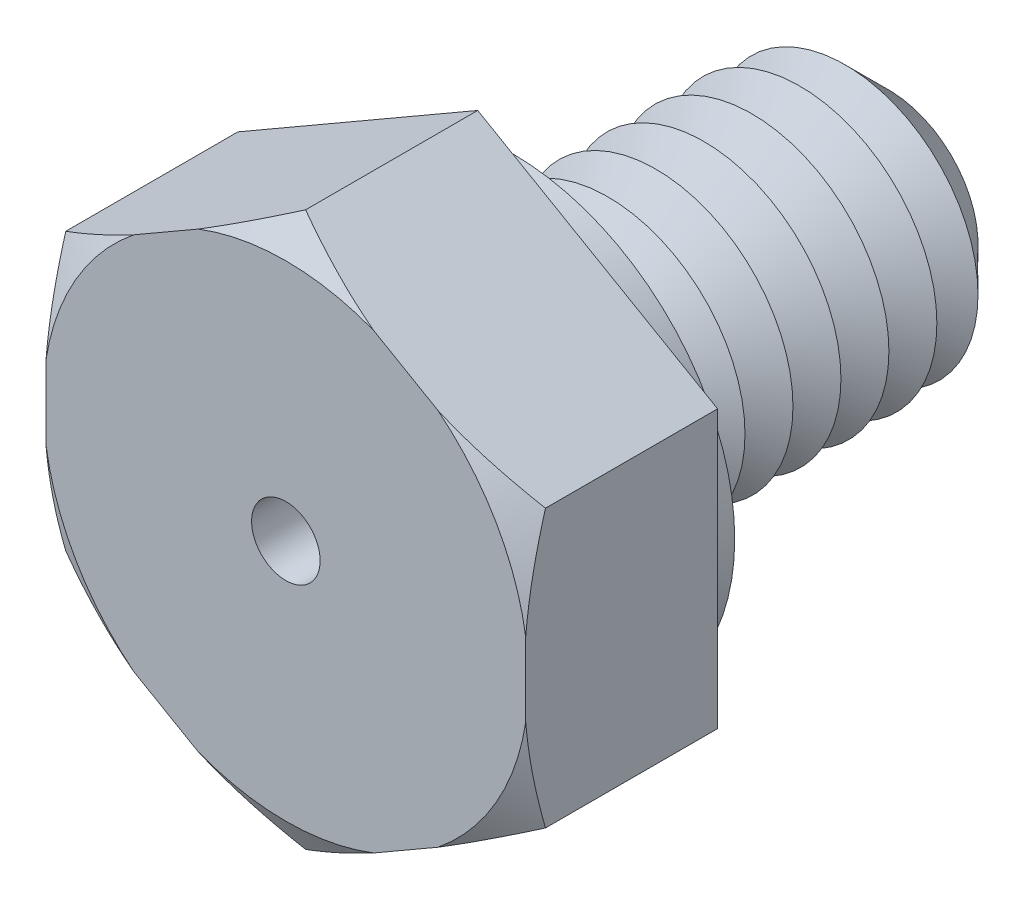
ISO-10303-21;
HEADER;
FILE_DESCRIPTION(('STEP AP214'),'2;1');
FILE_NAME('part.step','',(''),(''),'','','');
FILE_SCHEMA(('AUTOMOTIVE_DESIGN { 1 0 10303 214 1 1 1 1 }'));
ENDSEC;
DATA;
#1=APPLICATION_CONTEXT('core data for automotive mechanical design processes');
#2=APPLICATION_PROTOCOL_DEFINITION('international standard','automotive_design',2000,#1);
#3=PRODUCT_CONTEXT('',#1,'mechanical');
#4=PRODUCT('Part','Part','',(#3));
#5=PRODUCT_RELATED_PRODUCT_CATEGORY('part','',(#4));
#6=PRODUCT_DEFINITION_FORMATION('','',#4);
#7=PRODUCT_DEFINITION_CONTEXT('part definition',#1,'design');
#8=PRODUCT_DEFINITION('design','',#6,#7);
#9=PRODUCT_DEFINITION_SHAPE('','',#8);
#10=(LENGTH_UNIT() NAMED_UNIT(*) SI_UNIT(.MILLI.,.METRE.));
#11=(NAMED_UNIT(*) PLANE_ANGLE_UNIT() SI_UNIT($,.RADIAN.));
#12=(NAMED_UNIT(*) SI_UNIT($,.STERADIAN.) SOLID_ANGLE_UNIT());
#13=UNCERTAINTY_MEASURE_WITH_UNIT(LENGTH_MEASURE(1.E-05),#10,'distance_accuracy_value','');
#14=(GEOMETRIC_REPRESENTATION_CONTEXT(3) GLOBAL_UNCERTAINTY_ASSIGNED_CONTEXT((#13)) GLOBAL_UNIT_ASSIGNED_CONTEXT((#10,
#11,#12)) REPRESENTATION_CONTEXT('',''));
#15=CARTESIAN_POINT('',(0.,0.,0.));
#16=DIRECTION('',(0.,0.,1.));
#17=DIRECTION('',(1.,0.,0.));
#18=AXIS2_PLACEMENT_3D('',#15,#16,#17);
#19=CARTESIAN_POINT('',(3.5,2.02072594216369,2.8));
#20=DIRECTION('',(-0.5,-0.866025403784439,0.));
#21=DIRECTION('',(0.866025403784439,-0.5,0.));
#22=AXIS2_PLACEMENT_3D('',#19,#20,#21);
#23=PLANE('',#22);
#24=CARTESIAN_POINT('',(5.93124915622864,0.617043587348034,1.40176894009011));
#25=CARTESIAN_POINT('',(5.82127624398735,0.680536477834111,1.46111507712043));
#26=CARTESIAN_POINT('',(5.71104026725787,0.744181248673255,1.51982121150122));
#27=CARTESIAN_POINT('',(5.48993126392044,0.871838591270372,1.63565294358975));
#28=CARTESIAN_POINT('',(5.3790581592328,0.935851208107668,1.69277834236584));
#29=CARTESIAN_POINT('',(5.15623473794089,1.06449837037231,1.80531321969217));
#30=CARTESIAN_POINT('',(5.04428210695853,1.12913425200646,1.86071660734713));
#31=CARTESIAN_POINT('',(4.81953834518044,1.25889012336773,1.96920237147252));
#32=CARTESIAN_POINT('',(4.7067472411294,1.32401009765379,2.02228482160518));
#33=CARTESIAN_POINT('',(4.4773029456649,1.45647982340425,2.12693843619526));
#34=CARTESIAN_POINT('',(4.3606246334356,1.52384407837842,2.17843650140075));
#35=CARTESIAN_POINT('',(4.12610336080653,1.65924499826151,2.27776074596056));
#36=CARTESIAN_POINT('',(4.00826046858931,1.72728162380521,2.32558713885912));
#37=CARTESIAN_POINT('',(3.77136592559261,1.86405275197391,2.41666718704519));
#38=CARTESIAN_POINT('',(3.6523154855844,1.93278655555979,2.45992500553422));
#39=CARTESIAN_POINT('',(3.41281068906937,2.07106471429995,2.54086522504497));
#40=CARTESIAN_POINT('',(3.29235651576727,2.14060896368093,2.57854834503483));
#41=CARTESIAN_POINT('',(3.00433211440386,2.30689992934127,2.66006219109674));
#42=CARTESIAN_POINT('',(2.83610127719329,2.40402804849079,2.70086381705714));
#43=CARTESIAN_POINT('',(2.49725085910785,2.59966342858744,2.76622673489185));
#44=CARTESIAN_POINT('',(2.32663213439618,2.69817019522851,2.79079370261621));
#45=CARTESIAN_POINT('',(2.07079150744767,2.84587985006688,2.81342200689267));
#46=CARTESIAN_POINT('',(1.98601608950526,2.89482496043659,2.8186046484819));
#47=CARTESIAN_POINT('',(1.81634230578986,2.9927861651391,2.82423615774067));
#48=CARTESIAN_POINT('',(1.73144394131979,3.04180225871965,2.82468507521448));
#49=CARTESIAN_POINT('',(1.56172682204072,3.13978848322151,2.82082792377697));
#50=CARTESIAN_POINT('',(1.4769080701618,3.18875861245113,2.81652168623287));
#51=CARTESIAN_POINT('',(1.30753953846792,3.28654357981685,2.80328667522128));
#52=CARTESIAN_POINT('',(1.22298977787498,3.3353584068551,2.79435757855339));
#53=CARTESIAN_POINT('',(1.02330750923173,3.45064501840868,2.76803629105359));
#54=CARTESIAN_POINT('',(0.908361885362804,3.51700890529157,2.7487394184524));
#55=CARTESIAN_POINT('',(0.679569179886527,3.64910243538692,2.70286231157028));
#56=CARTESIAN_POINT('',(0.565722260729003,3.71483198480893,2.67628101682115));
#57=CARTESIAN_POINT('',(0.339141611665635,3.84564838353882,2.61683846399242));
#58=CARTESIAN_POINT('',(0.226409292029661,3.91073441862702,2.58397011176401));
#59=CARTESIAN_POINT('',(0.00220965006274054,4.04017614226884,2.512988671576));
#60=CARTESIAN_POINT('',(-0.109257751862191,4.10453187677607,2.47487591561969));
#61=CARTESIAN_POINT('',(-0.33232734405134,4.23332116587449,2.39383232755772));
#62=CARTESIAN_POINT('',(-0.443915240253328,4.29774646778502,2.35084938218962));
#63=CARTESIAN_POINT('',(-0.665905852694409,4.42591280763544,2.26126522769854));
#64=CARTESIAN_POINT('',(-0.776309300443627,4.48965426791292,2.2146664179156));
#65=CARTESIAN_POINT('',(-1.10600622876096,4.68000487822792,2.07044134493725));
#66=CARTESIAN_POINT('',(-1.3238418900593,4.80577235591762,1.96836549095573));
#67=CARTESIAN_POINT('',(-1.61545494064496,4.97413522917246,1.82536950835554));
#68=CARTESIAN_POINT('',(-1.69056073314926,5.01749757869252,1.78796601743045));
#69=CARTESIAN_POINT('',(-1.84044297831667,5.10403213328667,1.71229146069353));
#70=CARTESIAN_POINT('',(-1.91521944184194,5.14720434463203,1.67402042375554));
#71=CARTESIAN_POINT('',(-2.06368614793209,5.23292163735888,1.59712633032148));
#72=CARTESIAN_POINT('',(-2.13737951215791,5.27546852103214,1.55851128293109));
#73=CARTESIAN_POINT('',(-2.28450431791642,5.36041106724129,1.48061736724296));
#74=CARTESIAN_POINT('',(-2.35793575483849,5.40280672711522,1.44133848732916));
#75=CARTESIAN_POINT('',(-2.43124915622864,5.44513423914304,1.40176894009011));
#76=B_SPLINE_CURVE_WITH_KNOTS('',3,(#24,#25,#26,#27,#28,#29,#30,#31,#32,#33,#34,#35,#36,#37,#38,
#39,#40,#41,#42,#43,#44,#45,#46,#47,#48,#49,#50,#51,#52,#53,#54,#55,#56,#57,#58,#59,#60,#61,#62,
#63,#64,#65,#66,#67,#68,#69,#70,#71,#72,#73,#74,#75),.UNSPECIFIED.,.F.,.F.,(4,2,2,2,2,2,2,2,2,2,
2,2,2,2,2,2,2,2,2,2,2,2,2,2,2,4),(0.,0.420511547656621,0.841075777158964,1.26298883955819,
1.68488850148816,2.11755106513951,2.55018844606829,2.98242811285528,3.41461198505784,
4.0095520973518,4.60428410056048,4.89826759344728,5.19224799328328,5.48623881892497,
5.78025020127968,6.18237659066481,6.58456155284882,6.98720303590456,7.38981904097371,
7.79724423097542,8.20440134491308,9.01851321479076,9.30185450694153,9.58518638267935,
9.86552040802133,10.1458593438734),.UNSPECIFIED.);
#77=CARTESIAN_POINT('',(3.5,2.02072594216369,2.51132486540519));
#78=VERTEX_POINT('',#77);
#79=CARTESIAN_POINT('',(2.2178793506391,2.76095864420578,2.8));
#80=VERTEX_POINT('',#79);
#81=EDGE_CURVE('E132',#78,#80,#76,.T.);
#82=ORIENTED_EDGE('',*,*,#81,.F.);
#83=DIRECTION('',(0.,0.,-1.));
#84=VECTOR('',#83,1.);
#85=CARTESIAN_POINT('',(3.5,2.02072594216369,2.8));
#86=LINE('',#85,#84);
#87=CARTESIAN_POINT('',(3.5,2.02072594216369,0.));
#88=VERTEX_POINT('',#87);
#89=EDGE_CURVE('E144',#78,#88,#86,.T.);
#90=ORIENTED_EDGE('',*,*,#89,.T.);
#91=DIRECTION('',(-0.866025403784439,0.5,0.));
#92=VECTOR('',#91,1.);
#93=CARTESIAN_POINT('',(3.5,2.02072594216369,0.));
#94=LINE('',#93,#92);
#95=CARTESIAN_POINT('',(0.,4.04145188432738,0.));
#96=VERTEX_POINT('',#95);
#97=EDGE_CURVE('E259',#88,#96,#94,.T.);
#98=ORIENTED_EDGE('',*,*,#97,.T.);
#99=DIRECTION('',(0.,0.,-1.));
#100=VECTOR('',#99,1.);
#101=CARTESIAN_POINT('',(0.,4.04145188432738,2.8));
#102=LINE('',#101,#100);
#103=CARTESIAN_POINT('',(0.,4.04145188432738,2.51132486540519));
#104=VERTEX_POINT('',#103);
#105=EDGE_CURVE('E178',#104,#96,#102,.T.);
#106=ORIENTED_EDGE('',*,*,#105,.F.);
#107=CARTESIAN_POINT('',(1.2821206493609,3.30121918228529,2.8));
#108=VERTEX_POINT('',#107);
#109=EDGE_CURVE('E151',#108,#104,#76,.T.);
#110=ORIENTED_EDGE('',*,*,#109,.F.);
#111=DIRECTION('',(-0.866025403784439,0.5,0.));
#112=VECTOR('',#111,1.);
#113=CARTESIAN_POINT('',(3.5,2.02072594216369,2.8));
#114=LINE('',#113,#112);
#115=EDGE_CURVE('E148',#80,#108,#114,.T.);
#116=ORIENTED_EDGE('',*,*,#115,.F.);
#117=EDGE_LOOP('',(#82,#90,#98,#106,#110,#116));
#118=FACE_BOUND('',#117,.T.);
#119=ADVANCED_FACE('F39',(#118),#23,.F.);
#120=CARTESIAN_POINT('',(0.,4.04145188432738,2.8));
#121=DIRECTION('',(0.5,-0.866025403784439,0.));
#122=DIRECTION('',(0.866025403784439,0.5,0.));
#123=AXIS2_PLACEMENT_3D('',#120,#121,#122);
#124=PLANE('',#123);
#125=CARTESIAN_POINT('',(2.43124915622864,5.44513423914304,1.40176894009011));
#126=CARTESIAN_POINT('',(2.32127624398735,5.38164134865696,1.46111507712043));
#127=CARTESIAN_POINT('',(2.21104026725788,5.31799657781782,1.51982121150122));
#128=CARTESIAN_POINT('',(1.98993126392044,5.1903392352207,1.63565294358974));
#129=CARTESIAN_POINT('',(1.87905815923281,5.1263266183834,1.69277834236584));
#130=CARTESIAN_POINT('',(1.65623473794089,4.99767945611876,1.80531321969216));
#131=CARTESIAN_POINT('',(1.54428210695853,4.93304357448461,1.86071660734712));
#132=CARTESIAN_POINT('',(1.31953834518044,4.80328770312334,1.96920237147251));
#133=CARTESIAN_POINT('',(1.20674724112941,4.73816772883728,2.02228482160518));
#134=CARTESIAN_POINT('',(0.977302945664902,4.60569800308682,2.12693843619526));
#135=CARTESIAN_POINT('',(0.860624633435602,4.53833374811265,2.17843650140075));
#136=CARTESIAN_POINT('',(0.626103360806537,4.40293282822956,2.27776074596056));
#137=CARTESIAN_POINT('',(0.508260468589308,4.33489620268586,2.32558713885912));
#138=CARTESIAN_POINT('',(0.27136592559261,4.19812507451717,2.41666718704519));
#139=CARTESIAN_POINT('',(0.152315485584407,4.12939127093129,2.45992500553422));
#140=CARTESIAN_POINT('',(-0.0871893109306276,3.99111311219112,2.54086522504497));
#141=CARTESIAN_POINT('',(-0.20764348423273,3.92156886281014,2.57854834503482));
#142=CARTESIAN_POINT('',(-0.495667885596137,3.7552778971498,2.66006219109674));
#143=CARTESIAN_POINT('',(-0.663898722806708,3.65814977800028,2.70086381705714));
#144=CARTESIAN_POINT('',(-1.00274914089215,3.46251439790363,2.76622673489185));
#145=CARTESIAN_POINT('',(-1.17336786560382,3.36400763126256,2.79079370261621));
#146=CARTESIAN_POINT('',(-1.42920849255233,3.21629797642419,2.81342200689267));
#147=CARTESIAN_POINT('',(-1.51398391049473,3.16735286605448,2.8186046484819));
#148=CARTESIAN_POINT('',(-1.68365769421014,3.06939166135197,2.82423615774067));
#149=CARTESIAN_POINT('',(-1.76855605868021,3.02037556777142,2.82468507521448));
#150=CARTESIAN_POINT('',(-1.93827317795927,2.92238934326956,2.82082792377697));
#151=CARTESIAN_POINT('',(-2.02309192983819,2.87341921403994,2.81652168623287));
#152=CARTESIAN_POINT('',(-2.19246046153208,2.77563424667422,2.80328667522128));
#153=CARTESIAN_POINT('',(-2.27701022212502,2.72681941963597,2.79435757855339));
#154=CARTESIAN_POINT('',(-2.47669249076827,2.6115328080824,2.76803629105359));
#155=CARTESIAN_POINT('',(-2.59163811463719,2.5451689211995,2.7487394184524));
#156=CARTESIAN_POINT('',(-2.82043082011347,2.41307539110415,2.70286231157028));
#157=CARTESIAN_POINT('',(-2.93427773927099,2.34734584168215,2.67628101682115));
#158=CARTESIAN_POINT('',(-3.16085838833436,2.21652944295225,2.61683846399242));
#159=CARTESIAN_POINT('',(-3.27359070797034,2.15144340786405,2.58397011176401));
#160=CARTESIAN_POINT('',(-3.49779034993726,2.02200168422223,2.512988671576));
#161=CARTESIAN_POINT('',(-3.60925775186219,1.957645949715,2.47487591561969));
#162=CARTESIAN_POINT('',(-3.83232734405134,1.82885666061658,2.39383232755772));
#163=CARTESIAN_POINT('',(-3.94391524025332,1.76443135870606,2.35084938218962));
#164=CARTESIAN_POINT('',(-4.1659058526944,1.63626501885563,2.26126522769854));
#165=CARTESIAN_POINT('',(-4.27630930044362,1.57252355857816,2.2146664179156));
#166=CARTESIAN_POINT('',(-4.60600622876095,1.38217294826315,2.07044134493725));
#167=CARTESIAN_POINT('',(-4.8238418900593,1.25640547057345,1.96836549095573));
#168=CARTESIAN_POINT('',(-5.11545494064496,1.08804259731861,1.82536950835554));
#169=CARTESIAN_POINT('',(-5.19056073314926,1.04468024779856,1.78796601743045));
#170=CARTESIAN_POINT('',(-5.34044297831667,0.958145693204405,1.71229146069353));
#171=CARTESIAN_POINT('',(-5.41521944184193,0.914973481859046,1.67402042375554));
#172=CARTESIAN_POINT('',(-5.56368614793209,0.829256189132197,1.59712633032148));
#173=CARTESIAN_POINT('',(-5.63737951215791,0.786709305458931,1.55851128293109));
#174=CARTESIAN_POINT('',(-5.78450431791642,0.701766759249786,1.48061736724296));
#175=CARTESIAN_POINT('',(-5.85793575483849,0.659371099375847,1.44133848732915));
#176=CARTESIAN_POINT('',(-5.93124915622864,0.617043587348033,1.40176894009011));
#177=B_SPLINE_CURVE_WITH_KNOTS('',3,(#125,#126,#127,#128,#129,#130,#131,#132,#133,#134,#135,
#136,#137,#138,#139,#140,#141,#142,#143,#144,#145,#146,#147,#148,#149,#150,#151,#152,#153,#154,
#155,#156,#157,#158,#159,#160,#161,#162,#163,#164,#165,#166,#167,#168,#169,#170,#171,#172,#173,
#174,#175,#176),.UNSPECIFIED.,.F.,.F.,(4,2,2,2,2,2,2,2,2,2,2,2,2,2,2,2,2,2,2,2,2,2,2,2,2,4),(0.,
0.420511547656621,0.841075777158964,1.26298883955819,1.68488850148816,2.11755106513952,
2.55018844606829,2.98242811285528,3.41461198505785,4.0095520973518,4.60428410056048,
4.89826759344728,5.19224799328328,5.48623881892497,5.78025020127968,6.18237659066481,
6.58456155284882,6.98720303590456,7.38981904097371,7.79724423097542,8.20440134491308,
9.01851321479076,9.30185450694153,9.58518638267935,9.86552040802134,10.1458593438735),.UNSPECIFIED.);
#178=CARTESIAN_POINT('',(-1.2821206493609,3.30121918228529,2.8));
#179=VERTEX_POINT('',#178);
#180=EDGE_CURVE('E361',#104,#179,#177,.T.);
#181=ORIENTED_EDGE('',*,*,#180,.F.);
#182=ORIENTED_EDGE('',*,*,#105,.T.);
#183=DIRECTION('',(-0.866025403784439,-0.5,0.));
#184=VECTOR('',#183,1.);
#185=CARTESIAN_POINT('',(0.,4.04145188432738,0.));
#186=LINE('',#185,#184);
#187=CARTESIAN_POINT('',(-3.5,2.02072594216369,0.));
#188=VERTEX_POINT('',#187);
#189=EDGE_CURVE('E277',#96,#188,#186,.T.);
#190=ORIENTED_EDGE('',*,*,#189,.T.);
#191=DIRECTION('',(0.,0.,-1.));
#192=VECTOR('',#191,1.);
#193=CARTESIAN_POINT('',(-3.5,2.02072594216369,2.8));
#194=LINE('',#193,#192);
#195=CARTESIAN_POINT('',(-3.5,2.02072594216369,2.51132486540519));
#196=VERTEX_POINT('',#195);
#197=EDGE_CURVE('E175',#196,#188,#194,.T.);
#198=ORIENTED_EDGE('',*,*,#197,.F.);
#199=CARTESIAN_POINT('',(-2.2178793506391,2.76095864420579,2.8));
#200=VERTEX_POINT('',#199);
#201=EDGE_CURVE('E356',#200,#196,#177,.T.);
#202=ORIENTED_EDGE('',*,*,#201,.F.);
#203=DIRECTION('',(-0.866025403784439,-0.5,0.));
#204=VECTOR('',#203,1.);
#205=CARTESIAN_POINT('',(0.,4.04145188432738,2.8));
#206=LINE('',#205,#204);
#207=EDGE_CURVE('E262',#179,#200,#206,.T.);
#208=ORIENTED_EDGE('',*,*,#207,.F.);
#209=EDGE_LOOP('',(#181,#182,#190,#198,#202,#208));
#210=FACE_BOUND('',#209,.T.);
#211=ADVANCED_FACE('F350',(#210),#124,.F.);
#212=CARTESIAN_POINT('',(-3.5,2.02072594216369,2.8));
#213=DIRECTION('',(1.,0.,0.));
#214=DIRECTION('',(0.,1.,0.));
#215=AXIS2_PLACEMENT_3D('',#212,#213,#214);
#216=PLANE('',#215);
#217=CARTESIAN_POINT('',(-3.5,4.45197509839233,1.57509745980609));
#218=CARTESIAN_POINT('',(-3.5,4.32552348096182,1.632476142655));
#219=CARTESIAN_POINT('',(-3.5,4.19872625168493,1.68910722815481));
#220=CARTESIAN_POINT('',(-3.5,3.94429210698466,1.80051165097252));
#221=CARTESIAN_POINT('',(-3.5,3.81665504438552,1.85528465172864));
#222=CARTESIAN_POINT('',(-3.5,3.55990351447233,1.96281335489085));
#223=CARTESIAN_POINT('',(-3.5,3.43078510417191,2.01555968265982));
#224=CARTESIAN_POINT('',(-3.5,3.17145843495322,2.1182903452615));
#225=CARTESIAN_POINT('',(-3.5,3.04125022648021,2.16827480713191));
#226=CARTESIAN_POINT('',(-3.5,2.78016103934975,2.26465408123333));
#227=CARTESIAN_POINT('',(-3.5,2.64928566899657,2.31106393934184));
#228=CARTESIAN_POINT('',(-3.5,2.38615329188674,2.39977727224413));
#229=CARTESIAN_POINT('',(-3.5,2.25389619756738,2.44208048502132));
#230=CARTESIAN_POINT('',(-3.5,1.85519063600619,2.56138283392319));
#231=CARTESIAN_POINT('',(-3.5,1.58637912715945,2.63093897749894));
#232=CARTESIAN_POINT('',(-3.5,1.11975855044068,2.72563856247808));
#233=CARTESIAN_POINT('',(-3.5,0.923391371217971,2.75778053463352));
#234=CARTESIAN_POINT('',(-3.5,0.528527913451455,2.80406409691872));
#235=CARTESIAN_POINT('',(-3.5,0.330032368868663,2.81821170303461));
#236=CARTESIAN_POINT('',(-3.5,-0.0672968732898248,2.82680706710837));
#237=CARTESIAN_POINT('',(-3.5,-0.266130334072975,2.82126532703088));
#238=CARTESIAN_POINT('',(-3.5,-0.662321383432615,2.79120496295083));
#239=CARTESIAN_POINT('',(-3.5,-0.859678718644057,2.76668315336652));
#240=CARTESIAN_POINT('',(-3.5,-1.34971804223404,2.6850035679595));
#241=CARTESIAN_POINT('',(-3.5,-1.64068160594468,2.61765497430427));
#242=CARTESIAN_POINT('',(-3.5,-2.07181303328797,2.497569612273));
#243=CARTESIAN_POINT('',(-3.5,-2.21482517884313,2.45429352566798));
#244=CARTESIAN_POINT('',(-3.5,-2.49919378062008,2.36258423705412));
#245=CARTESIAN_POINT('',(-3.5,-2.64055035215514,2.31415139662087));
#246=CARTESIAN_POINT('',(-3.5,-2.92337235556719,2.2125676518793));
#247=CARTESIAN_POINT('',(-3.5,-3.06482042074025,2.15936898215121));
#248=CARTESIAN_POINT('',(-3.5,-3.34639535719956,2.04956763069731));
#249=CARTESIAN_POINT('',(-3.5,-3.48652214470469,1.99296473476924));
#250=CARTESIAN_POINT('',(-3.5,-3.76476497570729,1.87738368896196));
#251=CARTESIAN_POINT('',(-3.5,-3.90288810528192,1.81842250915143));
#252=CARTESIAN_POINT('',(-3.5,-4.1781332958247,1.6982956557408));
#253=CARTESIAN_POINT('',(-3.5,-4.31525559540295,1.6371305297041));
#254=CARTESIAN_POINT('',(-3.5,-4.45197509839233,1.57509745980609));
#255=B_SPLINE_CURVE_WITH_KNOTS('',3,(#217,#218,#219,#220,#221,#222,#223,#224,#225,#226,#227,
#228,#229,#230,#231,#232,#233,#234,#235,#236,#237,#238,#239,#240,#241,#242,#243,#244,#245,#246,
#247,#248,#249,#250,#251,#252,#253,#254),.UNSPECIFIED.,.F.,.F.,(4,2,2,2,2,2,2,2,2,2,2,2,2,2,2,2,
2,2,4),(0.,0.416588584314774,0.833252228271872,1.251655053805,1.67003861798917,2.08655215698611,
2.50309225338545,3.3347974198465,3.93106101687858,4.52712521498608,5.12287153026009,
5.71871785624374,6.61272902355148,7.0609327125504,7.50910499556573,7.96242043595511,
8.41576442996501,8.86628772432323,9.31669984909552),.UNSPECIFIED.);
#256=CARTESIAN_POINT('',(-3.5,0.540260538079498,2.8));
#257=VERTEX_POINT('',#256);
#258=EDGE_CURVE('E304',#196,#257,#255,.T.);
#259=ORIENTED_EDGE('',*,*,#258,.F.);
#260=ORIENTED_EDGE('',*,*,#197,.T.);
#261=DIRECTION('',(0.,-1.,0.));
#262=VECTOR('',#261,1.);
#263=CARTESIAN_POINT('',(-3.5,2.02072594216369,0.));
#264=LINE('',#263,#262);
#265=CARTESIAN_POINT('',(-3.5,-2.02072594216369,0.));
#266=VERTEX_POINT('',#265);
#267=EDGE_CURVE('E281',#188,#266,#264,.T.);
#268=ORIENTED_EDGE('',*,*,#267,.T.);
#269=DIRECTION('',(0.,0.,-1.));
#270=VECTOR('',#269,1.);
#271=CARTESIAN_POINT('',(-3.5,-2.02072594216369,2.8));
#272=LINE('',#271,#270);
#273=CARTESIAN_POINT('',(-3.5,-2.02072594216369,2.51132486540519));
#274=VERTEX_POINT('',#273);
#275=EDGE_CURVE('E172',#274,#266,#272,.T.);
#276=ORIENTED_EDGE('',*,*,#275,.F.);
#277=CARTESIAN_POINT('',(-3.5,-0.540260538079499,2.8));
#278=VERTEX_POINT('',#277);
#279=EDGE_CURVE('E297',#278,#274,#255,.T.);
#280=ORIENTED_EDGE('',*,*,#279,.F.);
#281=DIRECTION('',(0.,-1.,0.));
#282=VECTOR('',#281,1.);
#283=CARTESIAN_POINT('',(-3.5,2.02072594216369,2.8));
#284=LINE('',#283,#282);
#285=EDGE_CURVE('E266',#257,#278,#284,.T.);
#286=ORIENTED_EDGE('',*,*,#285,.F.);
#287=EDGE_LOOP('',(#259,#260,#268,#276,#280,#286));
#288=FACE_BOUND('',#287,.T.);
#289=ADVANCED_FACE('F353',(#288),#216,.F.);
#290=CARTESIAN_POINT('',(-3.5,-2.02072594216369,2.8));
#291=DIRECTION('',(0.5,0.866025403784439,0.));
#292=DIRECTION('',(-0.866025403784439,0.5,0.));
#293=AXIS2_PLACEMENT_3D('',#290,#291,#292);
#294=PLANE('',#293);
#295=CARTESIAN_POINT('',(-5.93124915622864,-0.617043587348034,1.40176894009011));
#296=CARTESIAN_POINT('',(-5.82127624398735,-0.68053647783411,1.46111507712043));
#297=CARTESIAN_POINT('',(-5.71104026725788,-0.744181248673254,1.51982121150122));
#298=CARTESIAN_POINT('',(-5.48993126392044,-0.871838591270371,1.63565294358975));
#299=CARTESIAN_POINT('',(-5.37905815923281,-0.935851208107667,1.69277834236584));
#300=CARTESIAN_POINT('',(-5.15623473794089,-1.06449837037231,1.80531321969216));
#301=CARTESIAN_POINT('',(-5.04428210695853,-1.12913425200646,1.86071660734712));
#302=CARTESIAN_POINT('',(-4.81953834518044,-1.25889012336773,1.96920237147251));
#303=CARTESIAN_POINT('',(-4.70674724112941,-1.32401009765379,2.02228482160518));
#304=CARTESIAN_POINT('',(-4.4773029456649,-1.45647982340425,2.12693843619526));
#305=CARTESIAN_POINT('',(-4.3606246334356,-1.52384407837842,2.17843650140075));
#306=CARTESIAN_POINT('',(-4.12610336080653,-1.65924499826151,2.27776074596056));
#307=CARTESIAN_POINT('',(-4.00826046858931,-1.72728162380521,2.32558713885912));
#308=CARTESIAN_POINT('',(-3.77136592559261,-1.86405275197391,2.41666718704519));
#309=CARTESIAN_POINT('',(-3.65231548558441,-1.93278655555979,2.45992500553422));
#310=CARTESIAN_POINT('',(-3.41281068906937,-2.07106471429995,2.54086522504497));
#311=CARTESIAN_POINT('',(-3.29235651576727,-2.14060896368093,2.57854834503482));
#312=CARTESIAN_POINT('',(-3.00433211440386,-2.30689992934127,2.66006219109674));
#313=CARTESIAN_POINT('',(-2.83610127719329,-2.40402804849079,2.70086381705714));
#314=CARTESIAN_POINT('',(-2.49725085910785,-2.59966342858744,2.76622673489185));
#315=CARTESIAN_POINT('',(-2.32663213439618,-2.69817019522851,2.79079370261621));
#316=CARTESIAN_POINT('',(-2.07079150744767,-2.84587985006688,2.81342200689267));
#317=CARTESIAN_POINT('',(-1.98601608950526,-2.89482496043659,2.8186046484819));
#318=CARTESIAN_POINT('',(-1.81634230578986,-2.9927861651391,2.82423615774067));
#319=CARTESIAN_POINT('',(-1.73144394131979,-3.04180225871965,2.82468507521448));
#320=CARTESIAN_POINT('',(-1.56172682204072,-3.13978848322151,2.82082792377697));
#321=CARTESIAN_POINT('',(-1.4769080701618,-3.18875861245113,2.81652168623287));
#322=CARTESIAN_POINT('',(-1.30753953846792,-3.28654357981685,2.80328667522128));
#323=CARTESIAN_POINT('',(-1.22298977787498,-3.3353584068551,2.79435757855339));
#324=CARTESIAN_POINT('',(-1.02330750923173,-3.45064501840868,2.76803629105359));
#325=CARTESIAN_POINT('',(-0.908361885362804,-3.51700890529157,2.7487394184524));
#326=CARTESIAN_POINT('',(-0.679569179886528,-3.64910243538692,2.70286231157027));
#327=CARTESIAN_POINT('',(-0.565722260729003,-3.71483198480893,2.67628101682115));
#328=CARTESIAN_POINT('',(-0.339141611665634,-3.84564838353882,2.61683846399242));
#329=CARTESIAN_POINT('',(-0.22640929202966,-3.91073441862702,2.58397011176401));
#330=CARTESIAN_POINT('',(-0.00220965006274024,-4.04017614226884,2.512988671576));
#331=CARTESIAN_POINT('',(0.109257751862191,-4.10453187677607,2.47487591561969));
#332=CARTESIAN_POINT('',(0.33232734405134,-4.2333211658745,2.39383232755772));
#333=CARTESIAN_POINT('',(0.443915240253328,-4.29774646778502,2.35084938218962));
#334=CARTESIAN_POINT('',(0.665905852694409,-4.42591280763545,2.26126522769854));
#335=CARTESIAN_POINT('',(0.776309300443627,-4.48965426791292,2.2146664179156));
#336=CARTESIAN_POINT('',(1.10600622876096,-4.68000487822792,2.07044134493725));
#337=CARTESIAN_POINT('',(1.3238418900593,-4.80577235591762,1.96836549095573));
#338=CARTESIAN_POINT('',(1.61545494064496,-4.97413522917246,1.82536950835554));
#339=CARTESIAN_POINT('',(1.69056073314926,-5.01749757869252,1.78796601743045));
#340=CARTESIAN_POINT('',(1.84044297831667,-5.10403213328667,1.71229146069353));
#341=CARTESIAN_POINT('',(1.91521944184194,-5.14720434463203,1.67402042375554));
#342=CARTESIAN_POINT('',(2.06368614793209,-5.23292163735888,1.59712633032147));
#343=CARTESIAN_POINT('',(2.13737951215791,-5.27546852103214,1.55851128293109));
#344=CARTESIAN_POINT('',(2.28450431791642,-5.36041106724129,1.48061736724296));
#345=CARTESIAN_POINT('',(2.35793575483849,-5.40280672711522,1.44133848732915));
#346=CARTESIAN_POINT('',(2.43124915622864,-5.44513423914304,1.40176894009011));
#347=B_SPLINE_CURVE_WITH_KNOTS('',3,(#295,#296,#297,#298,#299,#300,#301,#302,#303,#304,#305,
#306,#307,#308,#309,#310,#311,#312,#313,#314,#315,#316,#317,#318,#319,#320,#321,#322,#323,#324,
#325,#326,#327,#328,#329,#330,#331,#332,#333,#334,#335,#336,#337,#338,#339,#340,#341,#342,#343,
#344,#345,#346),.UNSPECIFIED.,.F.,.F.,(4,2,2,2,2,2,2,2,2,2,2,2,2,2,2,2,2,2,2,2,2,2,2,2,2,4),(0.,
0.420511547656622,0.841075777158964,1.26298883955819,1.68488850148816,2.11755106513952,
2.55018844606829,2.98242811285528,3.41461198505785,4.0095520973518,4.60428410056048,
4.89826759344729,5.19224799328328,5.48623881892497,5.78025020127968,6.18237659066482,
6.58456155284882,6.98720303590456,7.38981904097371,7.79724423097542,8.20440134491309,
9.01851321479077,9.30185450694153,9.58518638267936,9.86552040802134,10.1458593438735),.UNSPECIFIED.);
#348=CARTESIAN_POINT('',(-2.2178793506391,-2.76095864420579,2.8));
#349=VERTEX_POINT('',#348);
#350=EDGE_CURVE('E296',#274,#349,#347,.T.);
#351=ORIENTED_EDGE('',*,*,#350,.F.);
#352=ORIENTED_EDGE('',*,*,#275,.T.);
#353=DIRECTION('',(0.866025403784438,-0.5,0.));
#354=VECTOR('',#353,1.);
#355=CARTESIAN_POINT('',(-3.5,-2.02072594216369,0.));
#356=LINE('',#355,#354);
#357=CARTESIAN_POINT('',(0.,-4.04145188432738,0.));
#358=VERTEX_POINT('',#357);
#359=EDGE_CURVE('E285',#266,#358,#356,.T.);
#360=ORIENTED_EDGE('',*,*,#359,.T.);
#361=DIRECTION('',(0.,0.,-1.));
#362=VECTOR('',#361,1.);
#363=CARTESIAN_POINT('',(0.,-4.04145188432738,2.8));
#364=LINE('',#363,#362);
#365=CARTESIAN_POINT('',(0.,-4.04145188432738,2.51132486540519));
#366=VERTEX_POINT('',#365);
#367=EDGE_CURVE('E162',#366,#358,#364,.T.);
#368=ORIENTED_EDGE('',*,*,#367,.F.);
#369=CARTESIAN_POINT('',(-1.2821206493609,-3.30121918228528,2.8));
#370=VERTEX_POINT('',#369);
#371=EDGE_CURVE('E298',#370,#366,#347,.T.);
#372=ORIENTED_EDGE('',*,*,#371,.F.);
#373=DIRECTION('',(0.866025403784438,-0.5,0.));
#374=VECTOR('',#373,1.);
#375=CARTESIAN_POINT('',(-3.5,-2.02072594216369,2.8));
#376=LINE('',#375,#374);
#377=EDGE_CURVE('E270',#349,#370,#376,.T.);
#378=ORIENTED_EDGE('',*,*,#377,.F.);
#379=EDGE_LOOP('',(#351,#352,#360,#368,#372,#378));
#380=FACE_BOUND('',#379,.T.);
#381=ADVANCED_FACE('F322',(#380),#294,.F.);
#382=CARTESIAN_POINT('',(0.,-4.04145188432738,2.8));
#383=DIRECTION('',(-0.5,0.866025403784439,0.));
#384=DIRECTION('',(-0.866025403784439,-0.5,0.));
#385=AXIS2_PLACEMENT_3D('',#382,#383,#384);
#386=PLANE('',#385);
#387=CARTESIAN_POINT('',(-2.43124915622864,-5.44513423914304,1.40176894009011));
#388=CARTESIAN_POINT('',(-2.32127624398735,-5.38164134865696,1.46111507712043));
#389=CARTESIAN_POINT('',(-2.21104026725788,-5.31799657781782,1.51982121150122));
#390=CARTESIAN_POINT('',(-1.98993126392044,-5.1903392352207,1.63565294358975));
#391=CARTESIAN_POINT('',(-1.87905815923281,-5.1263266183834,1.69277834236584));
#392=CARTESIAN_POINT('',(-1.65623473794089,-4.99767945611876,1.80531321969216));
#393=CARTESIAN_POINT('',(-1.54428210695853,-4.93304357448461,1.86071660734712));
#394=CARTESIAN_POINT('',(-1.31953834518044,-4.80328770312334,1.96920237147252));
#395=CARTESIAN_POINT('',(-1.20674724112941,-4.73816772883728,2.02228482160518));
#396=CARTESIAN_POINT('',(-0.9773029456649,-4.60569800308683,2.12693843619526));
#397=CARTESIAN_POINT('',(-0.860624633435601,-4.53833374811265,2.17843650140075));
#398=CARTESIAN_POINT('',(-0.626103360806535,-4.40293282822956,2.27776074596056));
#399=CARTESIAN_POINT('',(-0.508260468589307,-4.33489620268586,2.32558713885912));
#400=CARTESIAN_POINT('',(-0.271365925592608,-4.19812507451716,2.41666718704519));
#401=CARTESIAN_POINT('',(-0.152315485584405,-4.12939127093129,2.45992500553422));
#402=CARTESIAN_POINT('',(0.0871893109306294,-3.99111311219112,2.54086522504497));
#403=CARTESIAN_POINT('',(0.207643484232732,-3.92156886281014,2.57854834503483));
#404=CARTESIAN_POINT('',(0.495667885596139,-3.7552778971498,2.66006219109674));
#405=CARTESIAN_POINT('',(0.663898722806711,-3.65814977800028,2.70086381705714));
#406=CARTESIAN_POINT('',(1.00274914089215,-3.46251439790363,2.76622673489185));
#407=CARTESIAN_POINT('',(1.17336786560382,-3.36400763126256,2.79079370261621));
#408=CARTESIAN_POINT('',(1.42920849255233,-3.21629797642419,2.81342200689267));
#409=CARTESIAN_POINT('',(1.51398391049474,-3.16735286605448,2.8186046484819));
#410=CARTESIAN_POINT('',(1.68365769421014,-3.06939166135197,2.82423615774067));
#411=CARTESIAN_POINT('',(1.76855605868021,-3.02037556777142,2.82468507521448));
#412=CARTESIAN_POINT('',(1.93827317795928,-2.92238934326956,2.82082792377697));
#413=CARTESIAN_POINT('',(2.0230919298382,-2.87341921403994,2.81652168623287));
#414=CARTESIAN_POINT('',(2.19246046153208,-2.77563424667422,2.80328667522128));
#415=CARTESIAN_POINT('',(2.27701022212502,-2.72681941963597,2.79435757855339));
#416=CARTESIAN_POINT('',(2.47669249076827,-2.6115328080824,2.76803629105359));
#417=CARTESIAN_POINT('',(2.5916381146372,-2.5451689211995,2.7487394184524));
#418=CARTESIAN_POINT('',(2.82043082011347,-2.41307539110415,2.70286231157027));
#419=CARTESIAN_POINT('',(2.934277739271,-2.34734584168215,2.67628101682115));
#420=CARTESIAN_POINT('',(3.16085838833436,-2.21652944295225,2.61683846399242));
#421=CARTESIAN_POINT('',(3.27359070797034,-2.15144340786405,2.58397011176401));
#422=CARTESIAN_POINT('',(3.49779034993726,-2.02200168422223,2.512988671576));
#423=CARTESIAN_POINT('',(3.60925775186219,-1.957645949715,2.47487591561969));
#424=CARTESIAN_POINT('',(3.83232734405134,-1.82885666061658,2.39383232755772));
#425=CARTESIAN_POINT('',(3.94391524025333,-1.76443135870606,2.35084938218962));
#426=CARTESIAN_POINT('',(4.16590585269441,-1.63626501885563,2.26126522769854));
#427=CARTESIAN_POINT('',(4.27630930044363,-1.57252355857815,2.2146664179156));
#428=CARTESIAN_POINT('',(4.60600622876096,-1.38217294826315,2.07044134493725));
#429=CARTESIAN_POINT('',(4.8238418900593,-1.25640547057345,1.96836549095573));
#430=CARTESIAN_POINT('',(5.11545494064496,-1.08804259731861,1.82536950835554));
#431=CARTESIAN_POINT('',(5.19056073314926,-1.04468024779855,1.78796601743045));
#432=CARTESIAN_POINT('',(5.34044297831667,-0.958145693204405,1.71229146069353));
#433=CARTESIAN_POINT('',(5.41521944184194,-0.914973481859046,1.67402042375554));
#434=CARTESIAN_POINT('',(5.56368614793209,-0.829256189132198,1.59712633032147));
#435=CARTESIAN_POINT('',(5.63737951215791,-0.786709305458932,1.55851128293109));
#436=CARTESIAN_POINT('',(5.78450431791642,-0.701766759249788,1.48061736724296));
#437=CARTESIAN_POINT('',(5.85793575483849,-0.659371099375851,1.44133848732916));
#438=CARTESIAN_POINT('',(5.93124915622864,-0.617043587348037,1.40176894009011));
#439=B_SPLINE_CURVE_WITH_KNOTS('',3,(#387,#388,#389,#390,#391,#392,#393,#394,#395,#396,#397,
#398,#399,#400,#401,#402,#403,#404,#405,#406,#407,#408,#409,#410,#411,#412,#413,#414,#415,#416,
#417,#418,#419,#420,#421,#422,#423,#424,#425,#426,#427,#428,#429,#430,#431,#432,#433,#434,#435,
#436,#437,#438),.UNSPECIFIED.,.F.,.F.,(4,2,2,2,2,2,2,2,2,2,2,2,2,2,2,2,2,2,2,2,2,2,2,2,2,4),(0.,
0.420511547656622,0.841075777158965,1.26298883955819,1.68488850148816,2.11755106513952,
2.55018844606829,2.98242811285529,3.41461198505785,4.0095520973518,4.60428410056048,
4.89826759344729,5.19224799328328,5.48623881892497,5.78025020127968,6.18237659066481,
6.58456155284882,6.98720303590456,7.38981904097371,7.79724423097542,8.20440134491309,
9.01851321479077,9.30185450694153,9.58518638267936,9.86552040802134,10.1458593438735),.UNSPECIFIED.);
#440=CARTESIAN_POINT('',(1.2821206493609,-3.30121918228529,2.8));
#441=VERTEX_POINT('',#440);
#442=EDGE_CURVE('E64',#366,#441,#439,.T.);
#443=ORIENTED_EDGE('',*,*,#442,.F.);
#444=ORIENTED_EDGE('',*,*,#367,.T.);
#445=DIRECTION('',(0.866025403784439,0.5,0.));
#446=VECTOR('',#445,1.);
#447=CARTESIAN_POINT('',(0.,-4.04145188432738,0.));
#448=LINE('',#447,#446);
#449=CARTESIAN_POINT('',(3.5,-2.02072594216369,0.));
#450=VERTEX_POINT('',#449);
#451=EDGE_CURVE('E288',#358,#450,#448,.T.);
#452=ORIENTED_EDGE('',*,*,#451,.T.);
#453=DIRECTION('',(0.,0.,-1.));
#454=VECTOR('',#453,1.);
#455=CARTESIAN_POINT('',(3.5,-2.02072594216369,2.8));
#456=LINE('',#455,#454);
#457=CARTESIAN_POINT('',(3.5,-2.02072594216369,2.51132486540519));
#458=VERTEX_POINT('',#457);
#459=EDGE_CURVE('E157',#458,#450,#456,.T.);
#460=ORIENTED_EDGE('',*,*,#459,.F.);
#461=CARTESIAN_POINT('',(2.2178793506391,-2.76095864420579,2.8));
#462=VERTEX_POINT('',#461);
#463=EDGE_CURVE('E313',#462,#458,#439,.T.);
#464=ORIENTED_EDGE('',*,*,#463,.F.);
#465=DIRECTION('',(0.866025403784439,0.5,0.));
#466=VECTOR('',#465,1.);
#467=CARTESIAN_POINT('',(0.,-4.04145188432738,2.8));
#468=LINE('',#467,#466);
#469=EDGE_CURVE('E165',#441,#462,#468,.T.);
#470=ORIENTED_EDGE('',*,*,#469,.F.);
#471=EDGE_LOOP('',(#443,#444,#452,#460,#464,#470));
#472=FACE_BOUND('',#471,.T.);
#473=ADVANCED_FACE('F391',(#472),#386,.F.);
#474=CARTESIAN_POINT('',(3.5,-2.02072594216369,2.8));
#475=DIRECTION('',(-1.,0.,0.));
#476=DIRECTION('',(0.,-1.,0.));
#477=AXIS2_PLACEMENT_3D('',#474,#475,#476);
#478=PLANE('',#477);
#479=CARTESIAN_POINT('',(3.5,-4.45197509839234,1.57509745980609));
#480=CARTESIAN_POINT('',(3.5,-4.32552348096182,1.632476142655));
#481=CARTESIAN_POINT('',(3.5,-4.19872625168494,1.68910722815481));
#482=CARTESIAN_POINT('',(3.5,-3.94429210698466,1.80051165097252));
#483=CARTESIAN_POINT('',(3.5,-3.81665504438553,1.85528465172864));
#484=CARTESIAN_POINT('',(3.5,-3.55990351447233,1.96281335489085));
#485=CARTESIAN_POINT('',(3.5,-3.43078510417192,2.01555968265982));
#486=CARTESIAN_POINT('',(3.5,-3.17145843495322,2.11829034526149));
#487=CARTESIAN_POINT('',(3.5,-3.04125022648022,2.16827480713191));
#488=CARTESIAN_POINT('',(3.5,-2.78016103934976,2.26465408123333));
#489=CARTESIAN_POINT('',(3.5,-2.64928566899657,2.31106393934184));
#490=CARTESIAN_POINT('',(3.5,-2.38615329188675,2.39977727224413));
#491=CARTESIAN_POINT('',(3.5,-2.25389619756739,2.44208048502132));
#492=CARTESIAN_POINT('',(3.5,-1.85519063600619,2.56138283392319));
#493=CARTESIAN_POINT('',(3.5,-1.58637912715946,2.63093897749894));
#494=CARTESIAN_POINT('',(3.5,-1.11975855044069,2.72563856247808));
#495=CARTESIAN_POINT('',(3.5,-0.923391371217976,2.75778053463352));
#496=CARTESIAN_POINT('',(3.5,-0.52852791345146,2.80406409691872));
#497=CARTESIAN_POINT('',(3.5,-0.330032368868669,2.81821170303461));
#498=CARTESIAN_POINT('',(3.5,0.0672968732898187,2.82680706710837));
#499=CARTESIAN_POINT('',(3.5,0.266130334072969,2.82126532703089));
#500=CARTESIAN_POINT('',(3.5,0.662321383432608,2.79120496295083));
#501=CARTESIAN_POINT('',(3.5,0.859678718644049,2.76668315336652));
#502=CARTESIAN_POINT('',(3.5,1.34971804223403,2.68500356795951));
#503=CARTESIAN_POINT('',(3.5,1.64068160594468,2.61765497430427));
#504=CARTESIAN_POINT('',(3.5,2.07181303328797,2.497569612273));
#505=CARTESIAN_POINT('',(3.5,2.21482517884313,2.45429352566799));
#506=CARTESIAN_POINT('',(3.5,2.49919378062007,2.36258423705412));
#507=CARTESIAN_POINT('',(3.5,2.64055035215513,2.31415139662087));
#508=CARTESIAN_POINT('',(3.5,2.92337235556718,2.2125676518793));
#509=CARTESIAN_POINT('',(3.5,3.06482042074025,2.15936898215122));
#510=CARTESIAN_POINT('',(3.5,3.34639535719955,2.04956763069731));
#511=CARTESIAN_POINT('',(3.5,3.48652214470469,1.99296473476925));
#512=CARTESIAN_POINT('',(3.5,3.76476497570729,1.87738368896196));
#513=CARTESIAN_POINT('',(3.5,3.90288810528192,1.81842250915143));
#514=CARTESIAN_POINT('',(3.5,4.1781332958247,1.6982956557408));
#515=CARTESIAN_POINT('',(3.5,4.31525559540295,1.6371305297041));
#516=CARTESIAN_POINT('',(3.5,4.45197509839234,1.57509745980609));
#517=B_SPLINE_CURVE_WITH_KNOTS('',3,(#479,#480,#481,#482,#483,#484,#485,#486,#487,#488,#489,
#490,#491,#492,#493,#494,#495,#496,#497,#498,#499,#500,#501,#502,#503,#504,#505,#506,#507,#508,
#509,#510,#511,#512,#513,#514,#515,#516),.UNSPECIFIED.,.F.,.F.,(4,2,2,2,2,2,2,2,2,2,2,2,2,2,2,2,
2,2,4),(0.,0.416588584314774,0.833252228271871,1.251655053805,1.67003861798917,2.08655215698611,
2.50309225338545,3.3347974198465,3.93106101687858,4.52712521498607,5.12287153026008,
5.71871785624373,6.61272902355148,7.0609327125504,7.50910499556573,7.9624204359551,
8.41576442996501,8.86628772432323,9.31669984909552),.UNSPECIFIED.);
#518=CARTESIAN_POINT('',(3.5,-0.540260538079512,2.8));
#519=VERTEX_POINT('',#518);
#520=EDGE_CURVE('E56',#458,#519,#517,.T.);
#521=ORIENTED_EDGE('',*,*,#520,.F.);
#522=ORIENTED_EDGE('',*,*,#459,.T.);
#523=DIRECTION('',(0.,1.,0.));
#524=VECTOR('',#523,1.);
#525=CARTESIAN_POINT('',(3.5,-2.02072594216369,0.));
#526=LINE('',#525,#524);
#527=EDGE_CURVE('E154',#450,#88,#526,.T.);
#528=ORIENTED_EDGE('',*,*,#527,.T.);
#529=ORIENTED_EDGE('',*,*,#89,.F.);
#530=CARTESIAN_POINT('',(3.5,0.540260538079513,2.8));
#531=VERTEX_POINT('',#530);
#532=EDGE_CURVE('E129',#531,#78,#517,.T.);
#533=ORIENTED_EDGE('',*,*,#532,.F.);
#534=DIRECTION('',(0.,1.,0.));
#535=VECTOR('',#534,1.);
#536=CARTESIAN_POINT('',(3.5,-2.02072594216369,2.8));
#537=LINE('',#536,#535);
#538=EDGE_CURVE('E158',#519,#531,#537,.T.);
#539=ORIENTED_EDGE('',*,*,#538,.F.);
#540=EDGE_LOOP('',(#521,#522,#528,#529,#533,#539));
#541=FACE_BOUND('',#540,.T.);
#542=ADVANCED_FACE('F152',(#541),#478,.F.);
#543=CARTESIAN_POINT('',(0.,0.,2.8));
#544=DIRECTION('',(0.,0.,1.));
#545=DIRECTION('',(1.,0.,0.));
#546=AXIS2_PLACEMENT_3D('',#543,#544,#545);
#547=PLANE('',#546);
#548=CARTESIAN_POINT('',(0.,0.,2.8));
#549=DIRECTION('',(0.,0.,1.));
#550=DIRECTION('',(1.,0.,0.));
#551=AXIS2_PLACEMENT_3D('',#548,#549,#550);
#552=CIRCLE('',#551,0.5);
#553=CARTESIAN_POINT('',(0.5,0.,2.8));
#554=VERTEX_POINT('',#553);
#555=EDGE_CURVE('E413',#554,#554,#552,.T.);
#556=ORIENTED_EDGE('',*,*,#555,.F.);
#557=EDGE_LOOP('',(#556));
#558=FACE_BOUND('',#557,.T.);
#559=ORIENTED_EDGE('',*,*,#538,.T.);
#560=CARTESIAN_POINT('',(0.,0.,2.8));
#561=DIRECTION('',(0.,0.,1.));
#562=DIRECTION('',(1.,0.,0.));
#563=AXIS2_PLACEMENT_3D('',#560,#561,#562);
#564=CIRCLE('',#563,3.54145188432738);
#565=EDGE_CURVE('E134',#531,#80,#564,.T.);
#566=ORIENTED_EDGE('',*,*,#565,.T.);
#567=ORIENTED_EDGE('',*,*,#115,.T.);
#568=CARTESIAN_POINT('',(0.,0.,2.8));
#569=DIRECTION('',(0.,0.,1.));
#570=DIRECTION('',(1.,0.,0.));
#571=AXIS2_PLACEMENT_3D('',#568,#569,#570);
#572=CIRCLE('',#571,3.54145188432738);
#573=EDGE_CURVE('E11',#108,#179,#572,.T.);
#574=ORIENTED_EDGE('',*,*,#573,.T.);
#575=ORIENTED_EDGE('',*,*,#207,.T.);
#576=EDGE_CURVE('E49',#200,#257,#572,.T.);
#577=ORIENTED_EDGE('',*,*,#576,.T.);
#578=ORIENTED_EDGE('',*,*,#285,.T.);
#579=EDGE_CURVE('E377',#278,#349,#572,.T.);
#580=ORIENTED_EDGE('',*,*,#579,.T.);
#581=ORIENTED_EDGE('',*,*,#377,.T.);
#582=EDGE_CURVE('E385',#370,#441,#572,.T.);
#583=ORIENTED_EDGE('',*,*,#582,.T.);
#584=ORIENTED_EDGE('',*,*,#469,.T.);
#585=EDGE_CURVE('E43',#462,#519,#572,.T.);
#586=ORIENTED_EDGE('',*,*,#585,.T.);
#587=EDGE_LOOP('',(#559,#566,#567,#574,#575,#577,#578,#580,#581,#583,#584,#586));
#588=FACE_BOUND('',#587,.T.);
#589=ADVANCED_FACE('F374',(#558,#588),#547,.T.);
#590=CARTESIAN_POINT('',(0.,0.,0.));
#591=DIRECTION('',(0.,0.,1.));
#592=DIRECTION('',(1.,0.,0.));
#593=AXIS2_PLACEMENT_3D('',#590,#591,#592);
#594=PLANE('',#593);
#595=CARTESIAN_POINT('',(0.,0.,0.));
#596=DIRECTION('',(0.,0.,1.));
#597=DIRECTION('',(1.,0.,0.));
#598=AXIS2_PLACEMENT_3D('',#595,#596,#597);
#599=CIRCLE('',#598,3.25);
#600=CARTESIAN_POINT('',(3.25,0.,0.));
#601=VERTEX_POINT('',#600);
#602=EDGE_CURVE('E181',#601,#601,#599,.F.);
#603=ORIENTED_EDGE('',*,*,#602,.F.);
#604=EDGE_LOOP('',(#603));
#605=FACE_BOUND('',#604,.T.);
#606=ORIENTED_EDGE('',*,*,#97,.F.);
#607=ORIENTED_EDGE('',*,*,#527,.F.);
#608=ORIENTED_EDGE('',*,*,#451,.F.);
#609=ORIENTED_EDGE('',*,*,#359,.F.);
#610=ORIENTED_EDGE('',*,*,#267,.F.);
#611=ORIENTED_EDGE('',*,*,#189,.F.);
#612=EDGE_LOOP('',(#606,#607,#608,#609,#610,#611));
#613=FACE_BOUND('',#612,.T.);
#614=ADVANCED_FACE('F428',(#605,#613),#594,.F.);
#615=CARTESIAN_POINT('',(0.,0.,-0.5));
#616=DIRECTION('',(0.,0.,1.));
#617=DIRECTION('',(1.,0.,0.));
#618=AXIS2_PLACEMENT_3D('',#615,#616,#617);
#619=CYLINDRICAL_SURFACE('',#618,3.25);
#620=CARTESIAN_POINT('',(0.,0.,-0.5));
#621=DIRECTION('',(0.,0.,-1.));
#622=DIRECTION('',(-1.,0.,0.));
#623=AXIS2_PLACEMENT_3D('',#620,#621,#622);
#624=CIRCLE('',#623,3.25);
#625=CARTESIAN_POINT('',(-3.25,0.,-0.5));
#626=VERTEX_POINT('',#625);
#627=EDGE_CURVE('E255',#626,#626,#624,.T.);
#628=ORIENTED_EDGE('',*,*,#627,.F.);
#629=EDGE_LOOP('',(#628));
#630=FACE_BOUND('',#629,.T.);
#631=ORIENTED_EDGE('',*,*,#602,.T.);
#632=EDGE_LOOP('',(#631));
#633=FACE_BOUND('',#632,.T.);
#634=ADVANCED_FACE('F430',(#630,#633),#619,.T.);
#635=CARTESIAN_POINT('',(0.,0.,-0.5));
#636=DIRECTION('',(0.,0.,-1.));
#637=DIRECTION('',(-1.,0.,0.));
#638=AXIS2_PLACEMENT_3D('',#635,#636,#637);
#639=PLANE('',#638);
#640=CARTESIAN_POINT('',(0.,0.,-0.5));
#641=DIRECTION('',(0.,0.,1.));
#642=DIRECTION('',(1.,0.,0.));
#643=AXIS2_PLACEMENT_3D('',#640,#641,#642);
#644=CIRCLE('',#643,2.);
#645=CARTESIAN_POINT('',(2.,0.,-0.5));
#646=VERTEX_POINT('',#645);
#647=EDGE_CURVE('E251',#646,#646,#644,.T.);
#648=ORIENTED_EDGE('',*,*,#647,.T.);
#649=EDGE_LOOP('',(#648));
#650=FACE_BOUND('',#649,.T.);
#651=ORIENTED_EDGE('',*,*,#627,.T.);
#652=EDGE_LOOP('',(#651));
#653=FACE_BOUND('',#652,.T.);
#654=ADVANCED_FACE('F437',(#650,#653),#639,.T.);
#655=CARTESIAN_POINT('',(0.,0.,-0.5));
#656=DIRECTION('',(0.,0.,1.));
#657=DIRECTION('',(1.,0.,0.));
#658=AXIS2_PLACEMENT_3D('',#655,#656,#657);
#659=CONICAL_SURFACE('',#658,2.,1.0471975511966);
#660=CARTESIAN_POINT('',(0.,0.,-0.85));
#661=DIRECTION('',(0.,0.,1.));
#662=DIRECTION('',(1.,0.,0.));
#663=AXIS2_PLACEMENT_3D('',#660,#661,#662);
#664=CIRCLE('',#663,1.39378221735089);
#665=CARTESIAN_POINT('',(1.39378221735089,0.,-0.85));
#666=VERTEX_POINT('',#665);
#667=EDGE_CURVE('E247',#666,#666,#664,.T.);
#668=ORIENTED_EDGE('',*,*,#667,.T.);
#669=EDGE_LOOP('',(#668));
#670=FACE_BOUND('',#669,.T.);
#671=ORIENTED_EDGE('',*,*,#647,.F.);
#672=EDGE_LOOP('',(#671));
#673=FACE_BOUND('',#672,.T.);
#674=ADVANCED_FACE('F662',(#670,#673),#659,.T.);
#675=CARTESIAN_POINT('',(0.,0.,-0.85));
#676=DIRECTION('',(0.,0.,-1.));
#677=DIRECTION('',(-1.,0.,0.));
#678=AXIS2_PLACEMENT_3D('',#675,#676,#677);
#679=CONICAL_SURFACE('',#678,1.39378221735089,1.0471975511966);
#680=CARTESIAN_POINT('',(0.,0.,-1.2));
#681=DIRECTION('',(0.,0.,1.));
#682=DIRECTION('',(1.,0.,0.));
#683=AXIS2_PLACEMENT_3D('',#680,#681,#682);
#684=CIRCLE('',#683,2.);
#685=CARTESIAN_POINT('',(2.,0.,-1.2));
#686=VERTEX_POINT('',#685);
#687=EDGE_CURVE('E243',#686,#686,#684,.T.);
#688=ORIENTED_EDGE('',*,*,#687,.T.);
#689=EDGE_LOOP('',(#688));
#690=FACE_BOUND('',#689,.T.);
#691=ORIENTED_EDGE('',*,*,#667,.F.);
#692=EDGE_LOOP('',(#691));
#693=FACE_BOUND('',#692,.T.);
#694=ADVANCED_FACE('F653',(#690,#693),#679,.T.);
#695=CARTESIAN_POINT('',(0.,0.,-1.2));
#696=DIRECTION('',(0.,0.,1.));
#697=DIRECTION('',(1.,0.,0.));
#698=AXIS2_PLACEMENT_3D('',#695,#696,#697);
#699=CONICAL_SURFACE('',#698,2.,1.0471975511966);
#700=CARTESIAN_POINT('',(0.,0.,-1.55));
#701=DIRECTION('',(0.,0.,1.));
#702=DIRECTION('',(1.,0.,0.));
#703=AXIS2_PLACEMENT_3D('',#700,#701,#702);
#704=CIRCLE('',#703,1.39378221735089);
#705=CARTESIAN_POINT('',(1.39378221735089,0.,-1.55));
#706=VERTEX_POINT('',#705);
#707=EDGE_CURVE('E239',#706,#706,#704,.T.);
#708=ORIENTED_EDGE('',*,*,#707,.T.);
#709=EDGE_LOOP('',(#708));
#710=FACE_BOUND('',#709,.T.);
#711=ORIENTED_EDGE('',*,*,#687,.F.);
#712=EDGE_LOOP('',(#711));
#713=FACE_BOUND('',#712,.T.);
#714=ADVANCED_FACE('F644',(#710,#713),#699,.T.);
#715=CARTESIAN_POINT('',(0.,0.,-1.55));
#716=DIRECTION('',(0.,0.,-1.));
#717=DIRECTION('',(-1.,0.,0.));
#718=AXIS2_PLACEMENT_3D('',#715,#716,#717);
#719=CONICAL_SURFACE('',#718,1.39378221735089,1.0471975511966);
#720=CARTESIAN_POINT('',(0.,0.,-1.9));
#721=DIRECTION('',(0.,0.,1.));
#722=DIRECTION('',(1.,0.,0.));
#723=AXIS2_PLACEMENT_3D('',#720,#721,#722);
#724=CIRCLE('',#723,2.);
#725=CARTESIAN_POINT('',(2.,0.,-1.9));
#726=VERTEX_POINT('',#725);
#727=EDGE_CURVE('E236',#726,#726,#724,.T.);
#728=ORIENTED_EDGE('',*,*,#727,.T.);
#729=EDGE_LOOP('',(#728));
#730=FACE_BOUND('',#729,.T.);
#731=ORIENTED_EDGE('',*,*,#707,.F.);
#732=EDGE_LOOP('',(#731));
#733=FACE_BOUND('',#732,.T.);
#734=ADVANCED_FACE('F635',(#730,#733),#719,.T.);
#735=CARTESIAN_POINT('',(0.,0.,-1.9));
#736=DIRECTION('',(0.,0.,1.));
#737=DIRECTION('',(1.,0.,0.));
#738=AXIS2_PLACEMENT_3D('',#735,#736,#737);
#739=CONICAL_SURFACE('',#738,2.,1.0471975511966);
#740=CARTESIAN_POINT('',(0.,0.,-2.25));
#741=DIRECTION('',(0.,0.,1.));
#742=DIRECTION('',(1.,0.,0.));
#743=AXIS2_PLACEMENT_3D('',#740,#741,#742);
#744=CIRCLE('',#743,1.39378221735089);
#745=CARTESIAN_POINT('',(1.39378221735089,0.,-2.25));
#746=VERTEX_POINT('',#745);
#747=EDGE_CURVE('E232',#746,#746,#744,.T.);
#748=ORIENTED_EDGE('',*,*,#747,.T.);
#749=EDGE_LOOP('',(#748));
#750=FACE_BOUND('',#749,.T.);
#751=ORIENTED_EDGE('',*,*,#727,.F.);
#752=EDGE_LOOP('',(#751));
#753=FACE_BOUND('',#752,.T.);
#754=ADVANCED_FACE('F626',(#750,#753),#739,.T.);
#755=CARTESIAN_POINT('',(0.,0.,-2.25));
#756=DIRECTION('',(0.,0.,-1.));
#757=DIRECTION('',(-1.,0.,0.));
#758=AXIS2_PLACEMENT_3D('',#755,#756,#757);
#759=CONICAL_SURFACE('',#758,1.39378221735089,1.0471975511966);
#760=CARTESIAN_POINT('',(0.,0.,-2.6));
#761=DIRECTION('',(0.,0.,1.));
#762=DIRECTION('',(1.,0.,0.));
#763=AXIS2_PLACEMENT_3D('',#760,#761,#762);
#764=CIRCLE('',#763,2.);
#765=CARTESIAN_POINT('',(2.,0.,-2.6));
#766=VERTEX_POINT('',#765);
#767=EDGE_CURVE('E228',#766,#766,#764,.T.);
#768=ORIENTED_EDGE('',*,*,#767,.T.);
#769=EDGE_LOOP('',(#768));
#770=FACE_BOUND('',#769,.T.);
#771=ORIENTED_EDGE('',*,*,#747,.F.);
#772=EDGE_LOOP('',(#771));
#773=FACE_BOUND('',#772,.T.);
#774=ADVANCED_FACE('F617',(#770,#773),#759,.T.);
#775=CARTESIAN_POINT('',(0.,0.,-2.6));
#776=DIRECTION('',(0.,0.,1.));
#777=DIRECTION('',(1.,0.,0.));
#778=AXIS2_PLACEMENT_3D('',#775,#776,#777);
#779=CONICAL_SURFACE('',#778,2.,1.0471975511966);
#780=CARTESIAN_POINT('',(0.,0.,-2.95));
#781=DIRECTION('',(0.,0.,1.));
#782=DIRECTION('',(1.,0.,0.));
#783=AXIS2_PLACEMENT_3D('',#780,#781,#782);
#784=CIRCLE('',#783,1.39378221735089);
#785=CARTESIAN_POINT('',(1.39378221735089,0.,-2.95));
#786=VERTEX_POINT('',#785);
#787=EDGE_CURVE('E224',#786,#786,#784,.T.);
#788=ORIENTED_EDGE('',*,*,#787,.T.);
#789=EDGE_LOOP('',(#788));
#790=FACE_BOUND('',#789,.T.);
#791=ORIENTED_EDGE('',*,*,#767,.F.);
#792=EDGE_LOOP('',(#791));
#793=FACE_BOUND('',#792,.T.);
#794=ADVANCED_FACE('F608',(#790,#793),#779,.T.);
#795=CARTESIAN_POINT('',(0.,0.,-2.95));
#796=DIRECTION('',(0.,0.,-1.));
#797=DIRECTION('',(-1.,0.,0.));
#798=AXIS2_PLACEMENT_3D('',#795,#796,#797);
#799=CONICAL_SURFACE('',#798,1.39378221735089,1.0471975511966);
#800=CARTESIAN_POINT('',(0.,0.,-3.3));
#801=DIRECTION('',(0.,0.,1.));
#802=DIRECTION('',(1.,0.,0.));
#803=AXIS2_PLACEMENT_3D('',#800,#801,#802);
#804=CIRCLE('',#803,2.);
#805=CARTESIAN_POINT('',(2.,0.,-3.3));
#806=VERTEX_POINT('',#805);
#807=EDGE_CURVE('E220',#806,#806,#804,.T.);
#808=ORIENTED_EDGE('',*,*,#807,.T.);
#809=EDGE_LOOP('',(#808));
#810=FACE_BOUND('',#809,.T.);
#811=ORIENTED_EDGE('',*,*,#787,.F.);
#812=EDGE_LOOP('',(#811));
#813=FACE_BOUND('',#812,.T.);
#814=ADVANCED_FACE('F599',(#810,#813),#799,.T.);
#815=CARTESIAN_POINT('',(0.,0.,-3.3));
#816=DIRECTION('',(0.,0.,1.));
#817=DIRECTION('',(1.,0.,0.));
#818=AXIS2_PLACEMENT_3D('',#815,#816,#817);
#819=CONICAL_SURFACE('',#818,2.,1.0471975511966);
#820=CARTESIAN_POINT('',(0.,0.,-3.65));
#821=DIRECTION('',(0.,0.,1.));
#822=DIRECTION('',(1.,0.,0.));
#823=AXIS2_PLACEMENT_3D('',#820,#821,#822);
#824=CIRCLE('',#823,1.39378221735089);
#825=CARTESIAN_POINT('',(1.39378221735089,0.,-3.65));
#826=VERTEX_POINT('',#825);
#827=EDGE_CURVE('E216',#826,#826,#824,.T.);
#828=ORIENTED_EDGE('',*,*,#827,.T.);
#829=EDGE_LOOP('',(#828));
#830=FACE_BOUND('',#829,.T.);
#831=ORIENTED_EDGE('',*,*,#807,.F.);
#832=EDGE_LOOP('',(#831));
#833=FACE_BOUND('',#832,.T.);
#834=ADVANCED_FACE('F590',(#830,#833),#819,.T.);
#835=CARTESIAN_POINT('',(0.,0.,-3.65));
#836=DIRECTION('',(0.,0.,-1.));
#837=DIRECTION('',(-1.,0.,0.));
#838=AXIS2_PLACEMENT_3D('',#835,#836,#837);
#839=CONICAL_SURFACE('',#838,1.39378221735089,1.0471975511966);
#840=CARTESIAN_POINT('',(0.,0.,-4.));
#841=DIRECTION('',(0.,0.,1.));
#842=DIRECTION('',(1.,0.,0.));
#843=AXIS2_PLACEMENT_3D('',#840,#841,#842);
#844=CIRCLE('',#843,2.);
#845=CARTESIAN_POINT('',(2.,0.,-4.));
#846=VERTEX_POINT('',#845);
#847=EDGE_CURVE('E199',#846,#846,#844,.T.);
#848=ORIENTED_EDGE('',*,*,#847,.T.);
#849=EDGE_LOOP('',(#848));
#850=FACE_BOUND('',#849,.T.);
#851=ORIENTED_EDGE('',*,*,#827,.F.);
#852=EDGE_LOOP('',(#851));
#853=FACE_BOUND('',#852,.T.);
#854=ADVANCED_FACE('F581',(#850,#853),#839,.T.);
#855=CARTESIAN_POINT('',(0.,0.,-4.));
#856=DIRECTION('',(0.,0.,1.));
#857=DIRECTION('',(1.,0.,0.));
#858=AXIS2_PLACEMENT_3D('',#855,#856,#857);
#859=CONICAL_SURFACE('',#858,2.,1.0471975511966);
#860=CARTESIAN_POINT('',(0.,0.,-4.35));
#861=DIRECTION('',(0.,0.,1.));
#862=DIRECTION('',(1.,0.,0.));
#863=AXIS2_PLACEMENT_3D('',#860,#861,#862);
#864=CIRCLE('',#863,1.39378221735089);
#865=CARTESIAN_POINT('',(1.39378221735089,0.,-4.35));
#866=VERTEX_POINT('',#865);
#867=EDGE_CURVE('E191',#866,#866,#864,.T.);
#868=ORIENTED_EDGE('',*,*,#867,.T.);
#869=EDGE_LOOP('',(#868));
#870=FACE_BOUND('',#869,.T.);
#871=ORIENTED_EDGE('',*,*,#847,.F.);
#872=EDGE_LOOP('',(#871));
#873=FACE_BOUND('',#872,.T.);
#874=ADVANCED_FACE('F573',(#870,#873),#859,.T.);
#875=CARTESIAN_POINT('',(0.,0.,-4.35));
#876=DIRECTION('',(0.,0.,-1.));
#877=DIRECTION('',(-1.,0.,0.));
#878=AXIS2_PLACEMENT_3D('',#875,#876,#877);
#879=CONICAL_SURFACE('',#878,1.39378221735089,1.0471975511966);
#880=CARTESIAN_POINT('',(0.,0.,-4.7));
#881=DIRECTION('',(0.,0.,1.));
#882=DIRECTION('',(1.,0.,0.));
#883=AXIS2_PLACEMENT_3D('',#880,#881,#882);
#884=CIRCLE('',#883,2.);
#885=CARTESIAN_POINT('',(2.,0.,-4.7));
#886=VERTEX_POINT('',#885);
#887=EDGE_CURVE('E192',#886,#886,#884,.T.);
#888=ORIENTED_EDGE('',*,*,#887,.T.);
#889=EDGE_LOOP('',(#888));
#890=FACE_BOUND('',#889,.T.);
#891=ORIENTED_EDGE('',*,*,#867,.F.);
#892=EDGE_LOOP('',(#891));
#893=FACE_BOUND('',#892,.T.);
#894=ADVANCED_FACE('F565',(#890,#893),#879,.T.);
#895=CARTESIAN_POINT('',(0.,0.,-4.7));
#896=DIRECTION('',(0.,0.,1.));
#897=DIRECTION('',(1.,0.,0.));
#898=AXIS2_PLACEMENT_3D('',#895,#896,#897);
#899=CONICAL_SURFACE('',#898,2.,1.0471975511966);
#900=CARTESIAN_POINT('',(0.,0.,-5.05));
#901=DIRECTION('',(0.,0.,1.));
#902=DIRECTION('',(1.,0.,0.));
#903=AXIS2_PLACEMENT_3D('',#900,#901,#902);
#904=CIRCLE('',#903,1.39378221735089);
#905=CARTESIAN_POINT('',(1.39378221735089,0.,-5.05));
#906=VERTEX_POINT('',#905);
#907=EDGE_CURVE('E203',#906,#906,#904,.T.);
#908=ORIENTED_EDGE('',*,*,#907,.T.);
#909=EDGE_LOOP('',(#908));
#910=FACE_BOUND('',#909,.T.);
#911=ORIENTED_EDGE('',*,*,#887,.F.);
#912=EDGE_LOOP('',(#911));
#913=FACE_BOUND('',#912,.T.);
#914=ADVANCED_FACE('F558',(#910,#913),#899,.T.);
#915=CARTESIAN_POINT('',(0.,0.,-5.05));
#916=DIRECTION('',(0.,0.,-1.));
#917=DIRECTION('',(-1.,0.,0.));
#918=AXIS2_PLACEMENT_3D('',#915,#916,#917);
#919=CONICAL_SURFACE('',#918,1.39378221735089,1.0471975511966);
#920=CARTESIAN_POINT('',(0.,0.,-5.36339745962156));
#921=DIRECTION('',(0.,0.,-1.));
#922=DIRECTION('',(-1.,0.,0.));
#923=AXIS2_PLACEMENT_3D('',#920,#921,#922);
#924=CIRCLE('',#923,1.93660254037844);
#925=CARTESIAN_POINT('',(-1.93660254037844,0.,-5.36339745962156));
#926=VERTEX_POINT('',#925);
#927=EDGE_CURVE('E188',#926,#926,#924,.T.);
#928=ORIENTED_EDGE('',*,*,#927,.F.);
#929=EDGE_LOOP('',(#928));
#930=FACE_BOUND('',#929,.T.);
#931=ORIENTED_EDGE('',*,*,#907,.F.);
#932=EDGE_LOOP('',(#931));
#933=FACE_BOUND('',#932,.T.);
#934=ADVANCED_FACE('F332',(#930,#933),#919,.T.);
#935=CARTESIAN_POINT('',(0.,0.,-6.));
#936=DIRECTION('',(0.,0.,-1.));
#937=DIRECTION('',(-1.,0.,0.));
#938=AXIS2_PLACEMENT_3D('',#935,#936,#937);
#939=PLANE('',#938);
#940=CARTESIAN_POINT('',(0.,0.,-6.));
#941=DIRECTION('',(0.,0.,-1.));
#942=DIRECTION('',(-1.,0.,0.));
#943=AXIS2_PLACEMENT_3D('',#940,#941,#942);
#944=CIRCLE('',#943,0.5);
#945=CARTESIAN_POINT('',(-0.5,0.,-6.));
#946=VERTEX_POINT('',#945);
#947=EDGE_CURVE('E416',#946,#946,#944,.F.);
#948=ORIENTED_EDGE('',*,*,#947,.T.);
#949=EDGE_LOOP('',(#948));
#950=FACE_BOUND('',#949,.T.);
#951=CARTESIAN_POINT('',(0.,0.,-6.));
#952=DIRECTION('',(0.,0.,-1.));
#953=DIRECTION('',(-1.,0.,0.));
#954=AXIS2_PLACEMENT_3D('',#951,#952,#953);
#955=CIRCLE('',#954,1.3);
#956=CARTESIAN_POINT('',(-1.3,0.,-6.));
#957=VERTEX_POINT('',#956);
#958=EDGE_CURVE('E185',#957,#957,#955,.T.);
#959=ORIENTED_EDGE('',*,*,#958,.T.);
#960=EDGE_LOOP('',(#959));
#961=FACE_BOUND('',#960,.T.);
#962=ADVANCED_FACE('F401',(#950,#961),#939,.T.);
#963=CARTESIAN_POINT('',(0.,0.,-6.));
#964=DIRECTION('',(0.,0.,1.));
#965=DIRECTION('',(1.,0.,0.));
#966=AXIS2_PLACEMENT_3D('',#963,#964,#965);
#967=CONICAL_SURFACE('',#966,1.3,0.785398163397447);
#968=ORIENTED_EDGE('',*,*,#958,.F.);
#969=EDGE_LOOP('',(#968));
#970=FACE_BOUND('',#969,.T.);
#971=ORIENTED_EDGE('',*,*,#927,.T.);
#972=EDGE_LOOP('',(#971));
#973=FACE_BOUND('',#972,.T.);
#974=ADVANCED_FACE('F41',(#970,#973),#967,.T.);
#975=CARTESIAN_POINT('',(0.,0.,2.8));
#976=DIRECTION('',(0.,0.,-1.));
#977=DIRECTION('',(-1.,0.,0.));
#978=AXIS2_PLACEMENT_3D('',#975,#976,#977);
#979=CONICAL_SURFACE('',#978,3.54145188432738,1.0471975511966);
#980=ORIENTED_EDGE('',*,*,#463,.T.);
#981=ORIENTED_EDGE('',*,*,#520,.T.);
#982=ORIENTED_EDGE('',*,*,#585,.F.);
#983=EDGE_LOOP('',(#980,#981,#982));
#984=FACE_BOUND('',#983,.T.);
#985=ADVANCED_FACE('F394',(#984),#979,.T.);
#986=ORIENTED_EDGE('',*,*,#371,.T.);
#987=ORIENTED_EDGE('',*,*,#442,.T.);
#988=ORIENTED_EDGE('',*,*,#582,.F.);
#989=EDGE_LOOP('',(#986,#987,#988));
#990=FACE_BOUND('',#989,.T.);
#991=ADVANCED_FACE('F396',(#990),#979,.T.);
#992=ORIENTED_EDGE('',*,*,#279,.T.);
#993=ORIENTED_EDGE('',*,*,#350,.T.);
#994=ORIENTED_EDGE('',*,*,#579,.F.);
#995=EDGE_LOOP('',(#992,#993,#994));
#996=FACE_BOUND('',#995,.T.);
#997=ADVANCED_FACE('F380',(#996),#979,.T.);
#998=ORIENTED_EDGE('',*,*,#201,.T.);
#999=ORIENTED_EDGE('',*,*,#258,.T.);
#1000=ORIENTED_EDGE('',*,*,#576,.F.);
#1001=EDGE_LOOP('',(#998,#999,#1000));
#1002=FACE_BOUND('',#1001,.T.);
#1003=ADVANCED_FACE('F329',(#1002),#979,.T.);
#1004=ORIENTED_EDGE('',*,*,#109,.T.);
#1005=ORIENTED_EDGE('',*,*,#180,.T.);
#1006=ORIENTED_EDGE('',*,*,#573,.F.);
#1007=EDGE_LOOP('',(#1004,#1005,#1006));
#1008=FACE_BOUND('',#1007,.T.);
#1009=ADVANCED_FACE('F324',(#1008),#979,.T.);
#1010=ORIENTED_EDGE('',*,*,#81,.T.);
#1011=ORIENTED_EDGE('',*,*,#565,.F.);
#1012=ORIENTED_EDGE('',*,*,#532,.T.);
#1013=EDGE_LOOP('',(#1010,#1011,#1012));
#1014=FACE_BOUND('',#1013,.T.);
#1015=ADVANCED_FACE('F131',(#1014),#979,.T.);
#1016=CARTESIAN_POINT('',(0.,0.,-7.41421356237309));
#1017=DIRECTION('',(0.,0.,1.));
#1018=DIRECTION('',(1.,0.,0.));
#1019=AXIS2_PLACEMENT_3D('',#1016,#1017,#1018);
#1020=CYLINDRICAL_SURFACE('',#1019,0.5);
#1021=ORIENTED_EDGE('',*,*,#555,.T.);
#1022=EDGE_LOOP('',(#1021));
#1023=FACE_BOUND('',#1022,.T.);
#1024=ORIENTED_EDGE('',*,*,#947,.F.);
#1025=EDGE_LOOP('',(#1024));
#1026=FACE_BOUND('',#1025,.T.);
#1027=ADVANCED_FACE('F331',(#1023,#1026),#1020,.F.);
#1028=CLOSED_SHELL('',(#119,#211,#289,#381,#473,#542,#589,#614,#634,#654,#674,#694,#714,#734,
#754,#774,#794,#814,#834,#854,#874,#894,#914,#934,#962,#974,#985,#991,#997,#1003,#1009,#1015,#1027));
#1029=MANIFOLD_SOLID_BREP('B2',#1028);
#1030=ADVANCED_BREP_SHAPE_REPRESENTATION('',(#18,#1029),#14);
#1031=SHAPE_DEFINITION_REPRESENTATION(#9,#1030);
ENDSEC;
END-ISO-10303-21;
